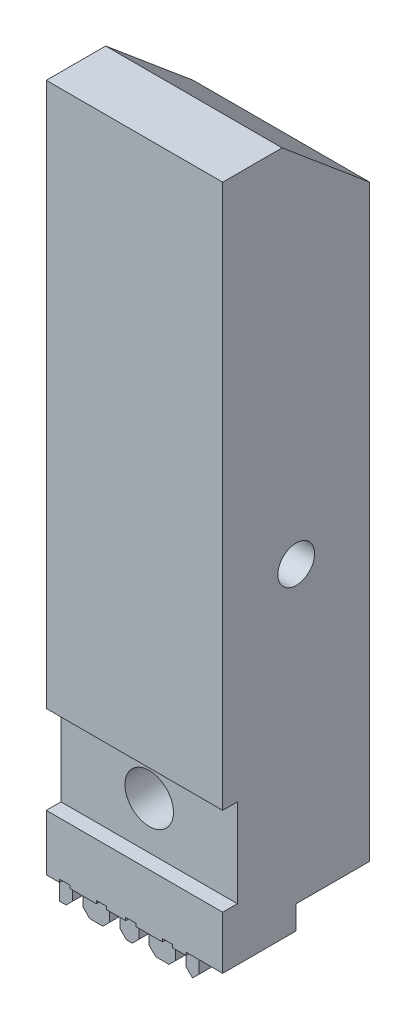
from build123d import *

# Parameters (mm, degrees)
EXTRUDE_1_DEPTH     = 10
SKETCH_2_R          = 1.65
CUT_EXTRUDE_1_DEPTH = 52.429563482
SKETCH_3_OUTSIDE_W  = 22.286
SKETCH_3_OUTSIDE_H  = 61.286
CUT_EXTRUDE_2_DEPTH = 52.429563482
SKETCH_4_R          = 1.25
CUT_EXTRUDE_3_DEPTH = 52.23904761


with BuildPart() as part:
    # Sketch 1 → Extrude 1 (new body)
    with BuildSketch(Plane.XY):
        Polygon((0, 0), (0, 49), (12, 49), (12, 2.2), (9.5, 2.2), (9.5, 0.45), (9.05, 0), (8.6, 0.45), (8.6, 2.2), (7.9, 2.2), (7.9, 0.45), (7.45, 0), (6.55, 0), (6.1, 0.45), (6.1, 2.2), (5.4, 2.2), (5.4, 0.45), (4.95, 0), (4.55, 0), (4.1, 0.45), (4.1, 2.2), (3.4, 2.2), (3.4, 0.45), (2.95, 0), (2.05, 0), (1.6, 0.45), (1.6, 2.2), (0.9, 2.2), (0.9, 0.45), (0.45, 0), align=None)
    extrude(amount=EXTRUDE_1_DEPTH)

    # Sketch 2 → Cut-Extrude 1 (cut, through all)
    with BuildSketch(Plane.XY.offset(10)):
        with Locations((6, 9)):
            Circle(SKETCH_2_R)
    extrude(amount=-CUT_EXTRUDE_1_DEPTH, mode=Mode.SUBTRACT)

    # Sketch 3 outside → Cut-Extrude 2 (cut, through all)
    with BuildSketch(Plane(origin=(12, 0, 0), x_dir=(0, 0, -1), z_dir=(1, 0, 0))):
        with Locations((-5, 24.5)):
            Rectangle(SKETCH_3_OUTSIDE_W, SKETCH_3_OUTSIDE_H)
        Polygon((-10, 2), (-9.1, 2), (-9.1, 0), (-8.3, 0), (-8.3, 2), (-5, 2), (-5, 3.8), (0, 3.8), (0, 43.8), (-5.958767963, 48.8), (-10, 48.8), (-10, 11.8), (-9, 11.8), (-9, 5.8), (-10, 5.8), align=None, mode=Mode.SUBTRACT)
    extrude(amount=-CUT_EXTRUDE_2_DEPTH, mode=Mode.SUBTRACT)

    # Sketch 4 → Cut-Extrude 3 (cut, through all)
    with BuildSketch(Plane(origin=(12, 0, 0), x_dir=(0, 0, -1), z_dir=(1, 0, 0))):
        with Locations(Location((-5, 23.8, 0), (0, 0, 90))):
            Circle(SKETCH_4_R)
    extrude(amount=-CUT_EXTRUDE_3_DEPTH, mode=Mode.SUBTRACT)


solid = part.part
